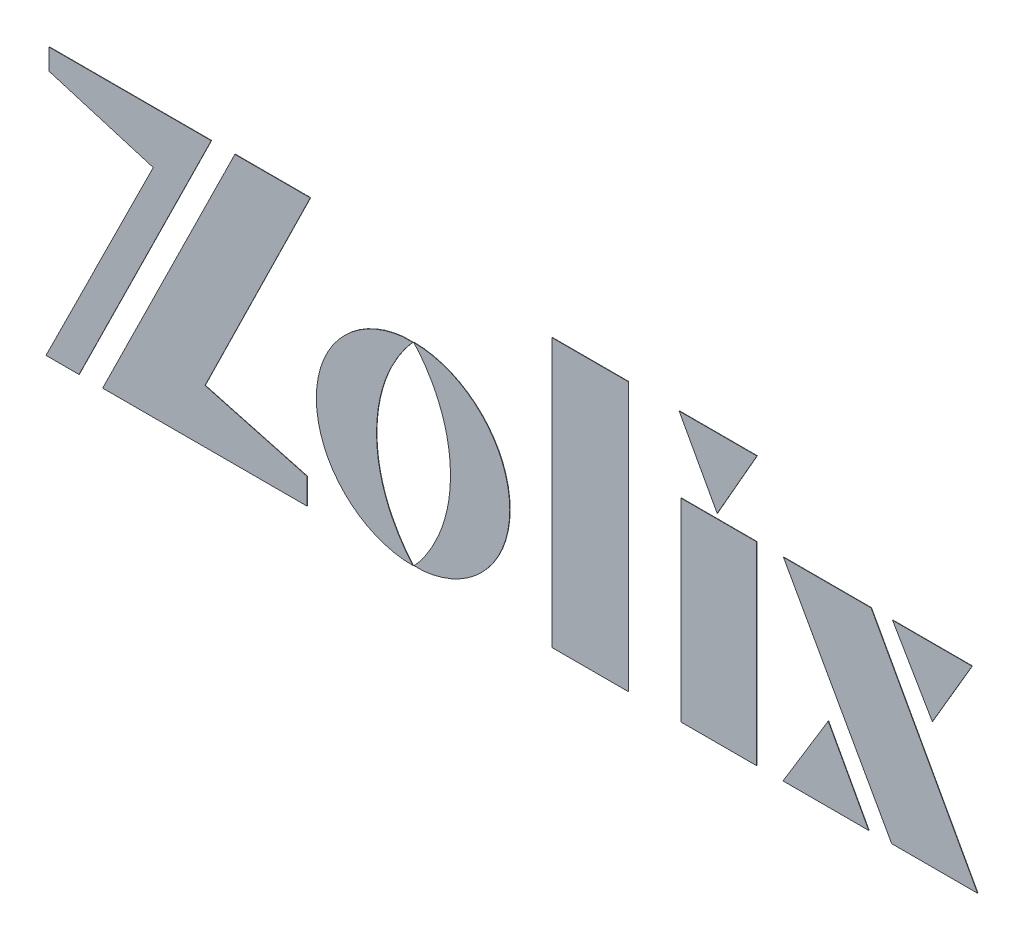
from build123d import *

# Parameters (mm, degrees)
SKETCH_1_W         = 9.745459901
SKETCH_1_H         = 34.356458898
EXTRUDE_1_DEPTH    = 0.05
EXTRUDE_1_2_DEPTH  = 0.05
EXTRUDE_1_3_DEPTH  = 0.05
EXTRUDE_1_4_DEPTH  = 0.05
EXTRUDE_1_5_DEPTH  = 0.05
EXTRUDE_1_6_DEPTH  = 0.05
EXTRUDE_1_7_DEPTH  = 0.05
EXTRUDE_1_8_DEPTH  = 0.05
SKETCH_1_W_2       = 9.712314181
SKETCH_1_H_2       = 24.824041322
EXTRUDE_1_9_DEPTH  = 0.05
EXTRUDE_1_10_DEPTH = 0.05


with BuildPart() as part:
    # Sketch 1 → Extrude 1 (new body)
    with BuildSketch(Plane.XY):
        with Locations((36.06555185, 10.065181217)):
            Rectangle(SKETCH_1_W, SKETCH_1_H)
    extrude(amount=EXTRUDE_1_DEPTH)


with BuildPart() as body_2:
    # Sketch 1 → Extrude 1 2 (new body)
    with BuildSketch(Plane.XY):
        Polygon((60.796099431, 17.71099309), (72.018646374, 17.71099309), (85.648559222, -7.113048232), (74.643781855, -7.113048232), align=None)
    extrude(amount=EXTRUDE_1_2_DEPTH)


with BuildPart() as body_3:
    # Sketch 1 → Extrude 1 3 (new body)
    with BuildSketch(Plane.XY):
        Polygon((74.764505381, 17.71099309), (84.938413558, 17.71099309), (79.853829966, 9.014171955), align=None)
    extrude(amount=EXTRUDE_1_3_DEPTH)


with BuildPart() as body_4:
    # Sketch 1 → Extrude 1 4 (new body)
    with BuildSketch(Plane.XY):
        Polygon((66.529278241, 2.416991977), (60.734548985, -7.113048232), (71.71328525, -7.113048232), align=None)
    extrude(amount=EXTRUDE_1_4_DEPTH)


with BuildPart() as body_5:
    # Sketch 1 → Extrude 1 5 (new body)
    with BuildSketch(Plane.XY):
        Polygon((8.71221867, 5.468225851), (8.764300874, 6.893230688), (8.913429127, 8.240125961), (9.145407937, 9.506534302), (9.443664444, 10.692469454), (9.798730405, 11.795554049), (10.196410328, 12.811047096), (10.620117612, 13.741325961), (11.498328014, 15.332031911), (12.322092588, 16.548735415), (12.982519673, 17.379604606), (13.370717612, 17.808052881), (12.130350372, 17.800948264), (10.899451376, 17.613947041), (9.713516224, 17.308585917), (8.574922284, 16.891969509), (7.490787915, 16.368838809), (6.468190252, 15.748648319), (5.51423391, 15.033775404), (4.633659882, 14.233688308), (3.833572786, 13.35311428), (3.121063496, 12.39917168), (2.49850938, 11.376574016), (1.977742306, 10.292425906), (1.561125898, 9.153831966), (1.255778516, 7.965546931), (1.066399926, 6.734634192), (1.002485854, 5.468225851), (1.066399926, 4.201803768), (1.255778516, 2.970904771), (1.561125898, 1.782605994), (1.977742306, 0.644025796), (2.49850938, -0.440122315), (3.121063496, -1.462719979), (3.833572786, -2.41667632), (4.633659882, -3.297250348), (5.51423391, -4.097337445), (6.468190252, -4.812210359), (7.490787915, -5.432387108), (8.574922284, -5.955531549), (9.713516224, -6.372147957), (10.899451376, -6.677495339), (12.130350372, -6.864510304), (13.399136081, -6.928424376), (13.22633035, -6.705913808), (12.333924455, -5.602829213), (11.510159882, -4.381384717), (10.629585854, -2.790678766), (10.203514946, -1.860399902), (9.805835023, -0.842529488), (9.448391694, 0.25817774), (9.147771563, 1.441735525), (8.913429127, 2.705780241), (8.764300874, 4.047948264), align=None)
    extrude(amount=EXTRUDE_1_5_DEPTH)


with BuildPart() as body_6:
    # Sketch 1 → Extrude 1 6 (new body)
    with BuildSketch(Plane.XY):
        Polygon((13.463036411, 17.864862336), (14.211055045, 17.015070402), (14.966164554, 15.987731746), (15.830165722, 14.581663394), (16.26808224, 13.741325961), (16.691803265, 12.811047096), (17.089483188, 11.795554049), (17.444549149, 10.692469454), (17.745169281, 9.506534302), (17.974784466, 8.240125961), (18.12391272, 6.893230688), (18.175994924, 5.468225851), (18.12391272, 4.047948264), (17.974784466, 2.705780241), (17.742805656, 1.441735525), (17.439808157, 0.25817774), (17.084742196, -0.842529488), (16.684698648, -1.860399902), (15.82069748, -3.6310162), (14.954332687, -5.039448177), (14.199223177, -6.071514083), (13.515118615, -6.869237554), (14.724717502, -6.859769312), (15.946161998, -6.668027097), (17.127356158, -6.360302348), (18.25884548, -5.941322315), (19.333511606, -5.418191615), (20.349018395, -4.798001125), (21.295856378, -4.08312821), (22.166962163, -3.285404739), (22.959958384, -2.407208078), (23.667726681, -1.453251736), (24.28317618, -0.433017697), (24.799216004, 0.648753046), (25.213455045, 1.784969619), (25.514075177, 2.970904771), (25.701090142, 4.201803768), (25.764990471, 5.468225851), (25.701090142, 6.729906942), (25.514075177, 7.956078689), (25.213455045, 9.137272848), (24.799216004, 10.271125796), (24.28317618, 11.350532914), (23.667726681, 12.370766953), (22.959958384, 13.322345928), (22.166962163, 14.20055633), (21.295856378, 14.99826606), (20.349018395, 15.713138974), (19.333511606, 16.33569309), (18.25884548, 16.861201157), (17.127356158, 17.282544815), (15.946161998, 17.595010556), (14.724717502, 17.791480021), align=None)
    extrude(amount=EXTRUDE_1_6_DEPTH)


with BuildPart() as body_7:
    # Sketch 1 → Extrude 1 7 (new body)
    with BuildSketch(Plane.XY):
        Polygon((0.230803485, 27.269451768), (-9.41996025, 27.269451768), (-26.349658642, -7.113048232), (-0.169240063, -7.113048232), (-0.169240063, -3.81327643), (-13.247603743, -0.267330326), align=None)
    extrude(amount=EXTRUDE_1_7_DEPTH)


with BuildPart() as body_8:
    # Sketch 1 → Extrude 1 8 (new body)
    with BuildSketch(Plane.XY):
        Polygon((-12.445153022, 27.269451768), (-29.372474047, -7.113048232), (-33.600161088, -7.113048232), (-19.87320219, 20.579952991), (-33.226158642, 24.589870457), (-33.226158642, 27.269451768), align=None)
    extrude(amount=EXTRUDE_1_8_DEPTH)


with BuildPart() as body_9:
    # Sketch 1 → Extrude 1 9 (new body)
    with BuildSketch(Plane.XY):
        with Locations((52.514706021, 5.298972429)):
            Rectangle(SKETCH_1_W_2, SKETCH_1_H_2)
    extrude(amount=EXTRUDE_1_9_DEPTH)


with BuildPart() as body_10:
    # Sketch 1 → Extrude 1 10 (new body)
    with BuildSketch(Plane.XY):
        Polygon((47.443142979, 27.243410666), (52.314684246, 18.32645633), (57.404008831, 27.243410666), align=None)
    extrude(amount=EXTRUDE_1_10_DEPTH)


solid = Compound([part.part, body_2.part, body_3.part, body_4.part, body_5.part, body_6.part, body_7.part, body_8.part, body_9.part, body_10.part])
